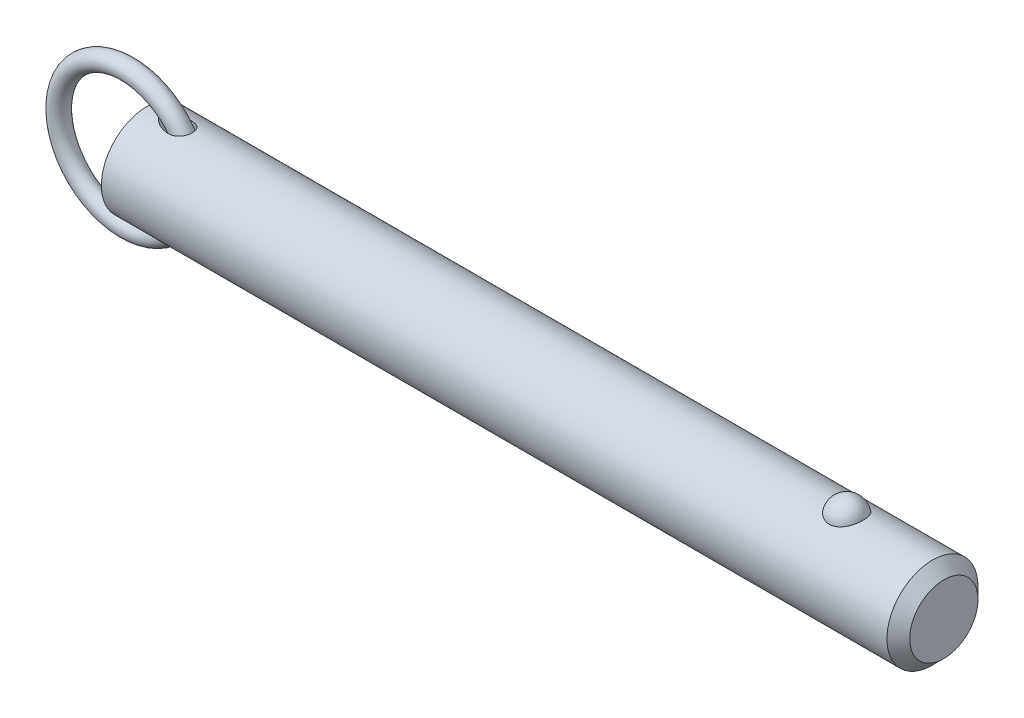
ISO-10303-21;
HEADER;
FILE_DESCRIPTION(('STEP AP214'),'2;1');
FILE_NAME('part.step','',(''),(''),'','','');
FILE_SCHEMA(('AUTOMOTIVE_DESIGN { 1 0 10303 214 1 1 1 1 }'));
ENDSEC;
DATA;
#1=APPLICATION_CONTEXT('core data for automotive mechanical design processes');
#2=APPLICATION_PROTOCOL_DEFINITION('international standard','automotive_design',2000,#1);
#3=PRODUCT_CONTEXT('',#1,'mechanical');
#4=PRODUCT('Part','Part','',(#3));
#5=PRODUCT_RELATED_PRODUCT_CATEGORY('part','',(#4));
#6=PRODUCT_DEFINITION_FORMATION('','',#4);
#7=PRODUCT_DEFINITION_CONTEXT('part definition',#1,'design');
#8=PRODUCT_DEFINITION('design','',#6,#7);
#9=PRODUCT_DEFINITION_SHAPE('','',#8);
#10=(LENGTH_UNIT() NAMED_UNIT(*) SI_UNIT(.MILLI.,.METRE.));
#11=(NAMED_UNIT(*) PLANE_ANGLE_UNIT() SI_UNIT($,.RADIAN.));
#12=(NAMED_UNIT(*) SI_UNIT($,.STERADIAN.) SOLID_ANGLE_UNIT());
#13=UNCERTAINTY_MEASURE_WITH_UNIT(LENGTH_MEASURE(1.E-05),#10,'distance_accuracy_value','');
#14=(GEOMETRIC_REPRESENTATION_CONTEXT(3) GLOBAL_UNCERTAINTY_ASSIGNED_CONTEXT((#13)) GLOBAL_UNIT_ASSIGNED_CONTEXT((#10,
#11,#12)) REPRESENTATION_CONTEXT('',''));
#15=CARTESIAN_POINT('',(0.,0.,0.));
#16=DIRECTION('',(0.,0.,1.));
#17=DIRECTION('',(1.,0.,0.));
#18=AXIS2_PLACEMENT_3D('',#15,#16,#17);
#19=CARTESIAN_POINT('',(-5.53898640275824,0.,0.));
#20=DIRECTION('',(0.,0.,1.));
#21=DIRECTION('',(1.,0.,0.));
#22=AXIS2_PLACEMENT_3D('',#19,#20,#21);
#23=TOROIDAL_SURFACE('',#22,19.05,2.54);
#24=CARTESIAN_POINT('',(16.0510135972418,0.,0.));
#25=VERTEX_POINT('',#24);
#26=VERTEX_LOOP('',#25);
#27=FACE_BOUND('',#26,.T.);
#28=ADVANCED_FACE('P0_F12',(#27),#23,.T.);
#29=CLOSED_SHELL('',(#28));
#30=MANIFOLD_SOLID_BREP('P0_B1',#29);
#31=CARTESIAN_POINT('',(0.,0.,0.));
#32=DIRECTION('',(1.,0.,0.));
#33=DIRECTION('',(0.,0.,-1.));
#34=AXIS2_PLACEMENT_3D('',#31,#32,#33);
#35=CYLINDRICAL_SURFACE('',#34,12.7);
#36=CARTESIAN_POINT('',(219.075,0.,0.));
#37=DIRECTION('',(1.,0.,0.));
#38=DIRECTION('',(0.,0.,-1.));
#39=AXIS2_PLACEMENT_3D('',#36,#37,#38);
#40=CIRCLE('',#39,12.7);
#41=CARTESIAN_POINT('',(219.075,0.,-12.7));
#42=VERTEX_POINT('',#41);
#43=EDGE_CURVE('P1_E89',#42,#42,#40,.T.);
#44=ORIENTED_EDGE('',*,*,#43,.F.);
#45=EDGE_LOOP('',(#44));
#46=FACE_BOUND('',#45,.T.);
#47=CARTESIAN_POINT('',(0.,0.,0.));
#48=DIRECTION('',(1.,0.,0.));
#49=DIRECTION('',(0.,0.,-1.));
#50=AXIS2_PLACEMENT_3D('',#47,#48,#49);
#51=CIRCLE('',#50,12.7);
#52=CARTESIAN_POINT('',(0.,0.,-12.7));
#53=VERTEX_POINT('',#52);
#54=EDGE_CURVE('P1_E52',#53,#53,#51,.T.);
#55=ORIENTED_EDGE('',*,*,#54,.T.);
#56=EDGE_LOOP('',(#55));
#57=FACE_BOUND('',#56,.T.);
#58=CARTESIAN_POINT('',(195.160042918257,11.7500437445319,4.81938502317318));
#59=CARTESIAN_POINT('',(195.035088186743,11.7500430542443,4.81938571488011));
#60=CARTESIAN_POINT('',(194.910144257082,11.7520975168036,4.81438658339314));
#61=CARTESIAN_POINT('',(194.661142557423,11.760253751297,4.79442904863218));
#62=CARTESIAN_POINT('',(194.537085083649,11.7663568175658,4.77946746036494));
#63=CARTESIAN_POINT('',(194.290901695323,11.7824262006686,4.7397141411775));
#64=CARTESIAN_POINT('',(194.168774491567,11.7923898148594,4.71492928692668));
#65=CARTESIAN_POINT('',(193.927187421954,11.8158938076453,4.65571340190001));
#66=CARTESIAN_POINT('',(193.80772859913,11.8294355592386,4.6212786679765));
#67=CARTESIAN_POINT('',(193.572557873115,11.8596812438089,4.54309502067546));
#68=CARTESIAN_POINT('',(193.456839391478,11.8763792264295,4.49936361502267));
#69=CARTESIAN_POINT('',(193.229653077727,11.9124878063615,4.40287235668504));
#70=CARTESIAN_POINT('',(193.118186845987,11.9318994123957,4.35010914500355));
#71=CARTESIAN_POINT('',(192.791278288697,11.9934256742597,4.17881316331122));
#72=CARTESIAN_POINT('',(192.583127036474,12.038858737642,4.04720756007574));
#73=CARTESIAN_POINT('',(192.185850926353,12.1352173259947,3.748564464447));
#74=CARTESIAN_POINT('',(191.997443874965,12.1862630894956,3.58061821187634));
#75=CARTESIAN_POINT('',(191.650521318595,12.2875163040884,3.21600758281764));
#76=CARTESIAN_POINT('',(191.492011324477,12.3377235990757,3.0193379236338));
#77=CARTESIAN_POINT('',(191.20168878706,12.4344923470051,2.592916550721));
#78=CARTESIAN_POINT('',(191.071376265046,12.4807925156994,2.36208286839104));
#79=CARTESIAN_POINT('',(190.849407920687,12.5623454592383,1.88070399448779));
#80=CARTESIAN_POINT('',(190.757755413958,12.5975972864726,1.63015711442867));
#81=CARTESIAN_POINT('',(190.614046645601,12.6538414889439,1.1129886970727));
#82=CARTESIAN_POINT('',(190.562499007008,12.6746503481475,0.846205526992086));
#83=CARTESIAN_POINT('',(190.501977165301,12.699153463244,0.307085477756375));
#84=CARTESIAN_POINT('',(190.493001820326,12.7028481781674,0.034748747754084));
#85=CARTESIAN_POINT('',(190.517731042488,12.6927785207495,-0.506073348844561));
#86=CARTESIAN_POINT('',(190.551189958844,12.6791146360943,-0.774571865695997));
#87=CARTESIAN_POINT('',(190.659687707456,12.635882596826,-1.30170246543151));
#88=CARTESIAN_POINT('',(190.73472729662,12.606314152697,-1.56033436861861));
#89=CARTESIAN_POINT('',(190.92500006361,12.5342328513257,-2.0608389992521));
#90=CARTESIAN_POINT('',(191.040287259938,12.4917026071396,-2.30268867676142));
#91=CARTESIAN_POINT('',(191.308704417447,12.3981123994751,-2.76259600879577));
#92=CARTESIAN_POINT('',(191.461837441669,12.3470517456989,-2.98065173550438));
#93=CARTESIAN_POINT('',(191.803507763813,12.2416045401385,-3.38786328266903));
#94=CARTESIAN_POINT('',(191.992201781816,12.1872040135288,-3.57688418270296));
#95=CARTESIAN_POINT('',(192.400239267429,12.0814086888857,-3.91941073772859));
#96=CARTESIAN_POINT('',(192.619580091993,12.0300136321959,-4.07291945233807));
#97=CARTESIAN_POINT('',(193.078375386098,11.9373542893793,-4.33691289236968));
#98=CARTESIAN_POINT('',(193.317304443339,11.8958982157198,-4.44824125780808));
#99=CARTESIAN_POINT('',(193.81243761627,11.8268116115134,-4.62881985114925));
#100=CARTESIAN_POINT('',(194.068635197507,11.7991758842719,-4.69808589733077));
#101=CARTESIAN_POINT('',(194.577164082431,11.7622209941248,-4.78983181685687));
#102=CARTESIAN_POINT('',(194.829041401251,11.7520502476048,-4.81449025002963));
#103=CARTESIAN_POINT('',(195.333573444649,11.7485796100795,-4.82295735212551));
#104=CARTESIAN_POINT('',(195.586228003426,11.7552763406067,-4.80677420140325));
#105=CARTESIAN_POINT('',(196.076834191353,11.7842584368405,-4.73525430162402));
#106=CARTESIAN_POINT('',(196.314998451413,11.8060486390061,-4.68116061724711));
#107=CARTESIAN_POINT('',(196.778489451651,11.8622750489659,-4.53678133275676));
#108=CARTESIAN_POINT('',(197.003815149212,11.8967122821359,-4.44649279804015));
#109=CARTESIAN_POINT('',(197.440801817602,11.9754603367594,-4.2298761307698));
#110=CARTESIAN_POINT('',(197.652057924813,12.0199699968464,-4.10280539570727));
#111=CARTESIAN_POINT('',(198.050601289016,12.1138028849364,-3.81685409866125));
#112=CARTESIAN_POINT('',(198.237883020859,12.163127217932,-3.65796622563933));
#113=CARTESIAN_POINT('',(198.593350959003,12.2642343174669,-3.30364864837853));
#114=CARTESIAN_POINT('',(198.760111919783,12.3160165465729,-3.10678783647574));
#115=CARTESIAN_POINT('',(199.059579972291,12.4142566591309,-2.68748409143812));
#116=CARTESIAN_POINT('',(199.192280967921,12.4607135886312,-2.4650365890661));
#117=CARTESIAN_POINT('',(199.424691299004,12.5450236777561,-1.9928951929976));
#118=CARTESIAN_POINT('',(199.523215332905,12.5825557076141,-1.74255918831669));
#119=CARTESIAN_POINT('',(199.679227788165,12.6431720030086,-1.22773734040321));
#120=CARTESIAN_POINT('',(199.736715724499,12.6662560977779,-0.963251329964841));
#121=CARTESIAN_POINT('',(199.809544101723,12.6956486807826,-0.4273550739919));
#122=CARTESIAN_POINT('',(199.824837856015,12.7019385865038,-0.155937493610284));
#123=CARTESIAN_POINT('',(199.812779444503,12.6970201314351,0.38592890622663));
#124=CARTESIAN_POINT('',(199.78542805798,12.6858120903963,0.656377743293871));
#125=CARTESIAN_POINT('',(199.713060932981,12.6568455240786,1.05454017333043));
#126=CARTESIAN_POINT('',(199.683796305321,12.6451962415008,1.185778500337));
#127=CARTESIAN_POINT('',(199.615022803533,12.6181819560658,1.44513808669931));
#128=CARTESIAN_POINT('',(199.575517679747,12.6028183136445,1.57326046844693));
#129=CARTESIAN_POINT('',(199.486439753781,12.5687547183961,1.82554978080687));
#130=CARTESIAN_POINT('',(199.436862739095,12.5500533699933,1.94971503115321));
#131=CARTESIAN_POINT('',(199.32792115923,12.5098093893,2.19314370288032));
#132=CARTESIAN_POINT('',(199.268560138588,12.4882677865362,2.31240887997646));
#133=CARTESIAN_POINT('',(199.13997128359,12.4427679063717,2.5459303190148));
#134=CARTESIAN_POINT('',(199.070688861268,12.4187964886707,2.66015396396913));
#135=CARTESIAN_POINT('',(198.922903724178,12.3691892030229,2.88202659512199));
#136=CARTESIAN_POINT('',(198.844404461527,12.3435539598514,2.98967802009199));
#137=CARTESIAN_POINT('',(198.678550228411,12.2912955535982,3.1977438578));
#138=CARTESIAN_POINT('',(198.591191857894,12.2646720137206,3.29815546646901));
#139=CARTESIAN_POINT('',(198.408161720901,12.2111945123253,3.49095035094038));
#140=CARTESIAN_POINT('',(198.312493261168,12.1843406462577,3.58333679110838));
#141=CARTESIAN_POINT('',(198.113627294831,12.1312249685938,3.75922876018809));
#142=CARTESIAN_POINT('',(198.010450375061,12.104961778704,3.84275713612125));
#143=CARTESIAN_POINT('',(197.79701336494,12.0537284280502,4.00056406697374));
#144=CARTESIAN_POINT('',(197.686756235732,12.028757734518,4.07484645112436));
#145=CARTESIAN_POINT('',(197.459755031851,11.9808306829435,4.21367959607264));
#146=CARTESIAN_POINT('',(197.343006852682,11.9578756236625,4.27822410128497));
#147=CARTESIAN_POINT('',(197.10394258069,11.9147184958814,4.39698483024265));
#148=CARTESIAN_POINT('',(196.981628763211,11.894515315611,4.45120522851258));
#149=CARTESIAN_POINT('',(196.722952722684,11.8561129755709,4.55255353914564));
#150=CARTESIAN_POINT('',(196.586223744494,11.8381764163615,4.59884858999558));
#151=CARTESIAN_POINT('',(196.308608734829,11.8069093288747,4.67853897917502));
#152=CARTESIAN_POINT('',(196.167724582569,11.7935767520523,4.71194005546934));
#153=CARTESIAN_POINT('',(195.88309446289,11.7720277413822,4.76552188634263));
#154=CARTESIAN_POINT('',(195.739348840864,11.7638106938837,4.78570422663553));
#155=CARTESIAN_POINT('',(195.450411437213,11.7528195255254,4.81263433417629));
#156=CARTESIAN_POINT('',(195.305219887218,11.7500445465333,4.81938421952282));
#157=CARTESIAN_POINT('',(195.160042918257,11.7500437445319,4.81938502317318));
#158=B_SPLINE_CURVE_WITH_KNOTS('',3,(#58,#59,#60,#61,#62,#63,#64,#65,#66,#67,#68,#69,#70,#71,
#72,#73,#74,#75,#76,#77,#78,#79,#80,#81,#82,#83,#84,#85,#86,#87,#88,#89,#90,#91,#92,#93,#94,#95,
#96,#97,#98,#99,#100,#101,#102,#103,#104,#105,#106,#107,#108,#109,#110,#111,#112,#113,#114,#115,
#116,#117,#118,#119,#120,#121,#122,#123,#124,#125,#126,#127,#128,#129,#130,#131,#132,#133,#134,
#135,#136,#137,#138,#139,#140,#141,#142,#143,#144,#145,#146,#147,#148,#149,#150,#151,#152,#153,
#154,#155,#156,#157),.UNSPECIFIED.,.T.,.F.,(4,2,2,2,2,2,2,2,2,2,2,2,2,2,2,2,2,2,2,2,2,2,2,2,2,2,
2,2,2,2,2,2,2,2,2,2,2,2,2,2,2,2,2,2,2,2,2,2,2,4),(0.,0.374729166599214,0.749578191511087,
1.12416526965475,1.49889629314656,1.87292776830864,2.24709865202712,2.99481328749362,
3.76399449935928,4.53331735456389,5.3368391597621,6.14042986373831,6.95405296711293,
7.76765424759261,8.57656703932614,9.38549455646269,10.1955119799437,11.0055949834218,
11.8193353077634,12.6330054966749,13.4294141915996,14.2255231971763,14.9815786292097,
15.7374826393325,16.4696948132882,17.2019663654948,17.9501979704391,18.6986017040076,
19.4844704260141,20.2704797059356,21.0815215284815,21.8925729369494,22.7045213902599,
23.5164550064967,23.9209608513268,24.3253187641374,24.7298461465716,25.1342272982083,
25.54092555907,25.9474719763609,26.3541750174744,26.7607169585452,27.1661834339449,
27.5714814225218,27.9770386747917,28.3824315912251,28.8181206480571,29.2536155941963,
29.6890582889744,30.1244323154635),.UNSPECIFIED.);
#159=CARTESIAN_POINT('',(195.160042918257,11.7500437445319,4.81938502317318));
#160=VERTEX_POINT('',#159);
#161=EDGE_CURVE('P1_E80',#160,#160,#158,.T.);
#162=ORIENTED_EDGE('',*,*,#161,.T.);
#163=EDGE_LOOP('',(#162));
#164=FACE_BOUND('',#163,.T.);
#165=CARTESIAN_POINT('',(-5.53898640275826,0.,0.));
#166=DIRECTION('',(0.796400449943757,-0.604769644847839,0.));
#167=DIRECTION('',(0.604769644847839,0.796400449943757,0.));
#168=AXIS2_PLACEMENT_3D('',#165,#166,#167);
#169=ELLIPSE('',#168,15.9467514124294,12.7);
#170=CARTESIAN_POINT('',(4.09482149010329,12.6864319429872,0.586893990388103));
#171=VERTEX_POINT('',#170);
#172=CARTESIAN_POINT('',(4.09482149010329,12.6864319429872,-0.586893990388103));
#173=VERTEX_POINT('',#172);
#174=EDGE_CURVE('P1_E47',#171,#173,#169,.F.);
#175=ORIENTED_EDGE('',*,*,#174,.T.);
#176=CARTESIAN_POINT('',(4.0615317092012,12.6905758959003,-0.48916605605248));
#177=CARTESIAN_POINT('',(4.0811137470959,12.6881366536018,-0.552489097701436));
#178=CARTESIAN_POINT('',(4.10417851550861,12.6852663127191,-0.614604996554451));
#179=CARTESIAN_POINT('',(4.15628434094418,12.6787965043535,-0.736067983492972));
#180=CARTESIAN_POINT('',(4.18531032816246,12.6751988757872,-0.795421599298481));
#181=CARTESIAN_POINT('',(4.2791115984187,12.6636052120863,-0.967590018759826));
#182=CARTESIAN_POINT('',(4.35123408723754,12.654730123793,-1.07635920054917));
#183=CARTESIAN_POINT('',(4.49106800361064,12.6376715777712,-1.25922957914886));
#184=CARTESIAN_POINT('',(4.55601066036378,12.6297947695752,-1.33556751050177));
#185=CARTESIAN_POINT('',(4.69223626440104,12.6134116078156,-1.48232741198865));
#186=CARTESIAN_POINT('',(4.76352147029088,12.6049050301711,-1.55274725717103));
#187=CARTESIAN_POINT('',(4.91163946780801,12.587417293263,-1.68868704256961));
#188=CARTESIAN_POINT('',(4.98851399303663,12.5784327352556,-1.75416062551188));
#189=CARTESIAN_POINT('',(5.14630057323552,12.560235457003,-1.88003275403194));
#190=CARTESIAN_POINT('',(5.22721398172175,12.5510226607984,-1.94042957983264));
#191=CARTESIAN_POINT('',(5.45368877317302,12.5256514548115,-2.09966332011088));
#192=CARTESIAN_POINT('',(5.60261616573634,12.5094182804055,-2.19371988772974));
#193=CARTESIAN_POINT('',(5.90795545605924,12.4774211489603,-2.36893890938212));
#194=CARTESIAN_POINT('',(6.064372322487,12.4616575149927,-2.45009264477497));
#195=CARTESIAN_POINT('',(6.3830613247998,12.431227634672,-2.60008249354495));
#196=CARTESIAN_POINT('',(6.54533237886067,12.4165611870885,-2.66892086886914));
#197=CARTESIAN_POINT('',(6.87462618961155,12.3889351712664,-2.79435199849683));
#198=CARTESIAN_POINT('',(7.04164773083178,12.3759751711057,-2.85094785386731));
#199=CARTESIAN_POINT('',(7.38726647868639,12.3518460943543,-2.95377962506));
#200=CARTESIAN_POINT('',(7.56604577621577,12.3407843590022,-2.9994320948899));
#201=CARTESIAN_POINT('',(7.92698692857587,12.3219309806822,-3.07596683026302));
#202=CARTESIAN_POINT('',(8.10914972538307,12.314140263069,-3.1068449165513));
#203=CARTESIAN_POINT('',(8.47511457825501,12.3025918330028,-3.15226850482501));
#204=CARTESIAN_POINT('',(8.65890979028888,12.2988216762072,-3.16686440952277));
#205=CARTESIAN_POINT('',(9.0269608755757,12.2959421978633,-3.17802250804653));
#206=CARTESIAN_POINT('',(9.21121628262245,12.2968292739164,-3.17459864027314));
#207=CARTESIAN_POINT('',(9.61636263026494,12.3045198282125,-3.14471110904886));
#208=CARTESIAN_POINT('',(9.83695552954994,12.3125080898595,-3.1136323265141));
#209=CARTESIAN_POINT('',(10.1619126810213,12.3303028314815,-3.04206574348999));
#210=CARTESIAN_POINT('',(10.2692747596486,12.3372061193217,-3.01403983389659));
#211=CARTESIAN_POINT('',(10.4811758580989,12.3528538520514,-2.94925947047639));
#212=CARTESIAN_POINT('',(10.5857162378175,12.361597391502,-2.91250930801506));
#213=CARTESIAN_POINT('',(10.7921321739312,12.3808585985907,-2.82951748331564));
#214=CARTESIAN_POINT('',(10.8939665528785,12.3913944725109,-2.78317723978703));
#215=CARTESIAN_POINT('',(11.0926118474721,12.4138762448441,-2.68112002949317));
#216=CARTESIAN_POINT('',(11.1894254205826,12.4258213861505,-2.62540809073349));
#217=CARTESIAN_POINT('',(11.3768740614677,12.4507225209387,-2.50465655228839));
#218=CARTESIAN_POINT('',(11.46751150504,12.4636781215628,-2.43962056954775));
#219=CARTESIAN_POINT('',(11.6414572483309,12.4901070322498,-2.30048560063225));
#220=CARTESIAN_POINT('',(11.7247669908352,12.5035802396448,-2.2263884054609));
#221=CARTESIAN_POINT('',(11.8713131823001,12.5285000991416,-2.08117367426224));
#222=CARTESIAN_POINT('',(11.9357009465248,12.5399538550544,-2.0112159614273));
#223=CARTESIAN_POINT('',(12.0576805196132,12.5624496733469,-1.86555293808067));
#224=CARTESIAN_POINT('',(12.1152732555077,12.5734917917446,-1.7898484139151));
#225=CARTESIAN_POINT('',(12.223073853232,12.5947858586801,-1.63327883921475));
#226=CARTESIAN_POINT('',(12.2732844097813,12.6050380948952,-1.55241568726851));
#227=CARTESIAN_POINT('',(12.3658430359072,12.6243983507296,-1.38621267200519));
#228=CARTESIAN_POINT('',(12.4081916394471,12.6335064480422,-1.30087311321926));
#229=CARTESIAN_POINT('',(12.5150098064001,12.6569076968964,-1.05702619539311));
#230=CARTESIAN_POINT('',(12.5703399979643,12.6695746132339,-0.894232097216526));
#231=CARTESIAN_POINT('',(12.6526225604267,12.6886816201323,-0.561391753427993));
#232=CARTESIAN_POINT('',(12.6795825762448,12.6951233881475,-0.391347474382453));
#233=CARTESIAN_POINT('',(12.7041016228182,12.7009766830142,-0.0537636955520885));
#234=CARTESIAN_POINT('',(12.7024538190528,12.7005778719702,0.113714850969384));
#235=CARTESIAN_POINT('',(12.6717240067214,12.6932548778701,0.445979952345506));
#236=CARTESIAN_POINT('',(12.6426435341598,12.6863310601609,0.61076665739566));
#237=CARTESIAN_POINT('',(12.5579769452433,12.6667465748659,0.932429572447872));
#238=CARTESIAN_POINT('',(12.5024793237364,12.6541050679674,1.08933027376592));
#239=CARTESIAN_POINT('',(12.3665691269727,12.6244558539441,1.39146752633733));
#240=CARTESIAN_POINT('',(12.2861577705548,12.6074483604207,1.53670464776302));
#241=CARTESIAN_POINT('',(12.1018203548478,12.5706804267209,1.81319588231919));
#242=CARTESIAN_POINT('',(11.99765881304,12.5508932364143,1.94428915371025));
#243=CARTESIAN_POINT('',(11.7695265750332,12.5107540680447,2.18776051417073));
#244=CARTESIAN_POINT('',(11.6455540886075,12.4904020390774,2.30013691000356));
#245=CARTESIAN_POINT('',(11.3759347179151,12.4502278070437,2.50870972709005));
#246=CARTESIAN_POINT('',(11.2295880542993,12.4304654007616,2.60400962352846));
#247=CARTESIAN_POINT('',(10.9239803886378,12.3941696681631,2.7716292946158));
#248=CARTESIAN_POINT('',(10.7647152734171,12.3776373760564,2.84394171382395));
#249=CARTESIAN_POINT('',(10.4192039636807,12.3473062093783,2.9730352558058));
#250=CARTESIAN_POINT('',(10.2319332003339,12.3340204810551,3.02717164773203));
#251=CARTESIAN_POINT('',(9.85152982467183,12.3134301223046,3.10986173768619));
#252=CARTESIAN_POINT('',(9.65839336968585,12.3061295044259,3.13839827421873));
#253=CARTESIAN_POINT('',(9.31022514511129,12.2982822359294,3.16897517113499));
#254=CARTESIAN_POINT('',(9.15555718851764,12.2966525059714,3.1752689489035));
#255=CARTESIAN_POINT('',(8.84618945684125,12.2967963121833,3.17471335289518));
#256=CARTESIAN_POINT('',(8.69148970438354,12.2985715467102,3.16785742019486));
#257=CARTESIAN_POINT('',(8.38280471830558,12.3051648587,3.14214692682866));
#258=CARTESIAN_POINT('',(8.22882218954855,12.3099904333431,3.12326280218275));
#259=CARTESIAN_POINT('',(7.92276070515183,12.3222644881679,3.07448013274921));
#260=CARTESIAN_POINT('',(7.7706814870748,12.3297126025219,3.04458312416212));
#261=CARTESIAN_POINT('',(7.4645266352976,12.3470493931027,2.97350781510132));
#262=CARTESIAN_POINT('',(7.3105271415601,12.3570043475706,2.93201910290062));
#263=CARTESIAN_POINT('',(7.00579083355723,12.3787609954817,2.83876185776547));
#264=CARTESIAN_POINT('',(6.85505451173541,12.3905629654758,2.78699178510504));
#265=CARTESIAN_POINT('',(6.55781208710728,12.415528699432,2.67357744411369));
#266=CARTESIAN_POINT('',(6.41129783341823,12.4286895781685,2.61195394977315));
#267=CARTESIAN_POINT('',(6.12302950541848,12.4559398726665,2.47874512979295));
#268=CARTESIAN_POINT('',(5.98127390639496,12.4700289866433,2.40716303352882));
#269=CARTESIAN_POINT('',(5.67073126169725,12.5020754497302,2.23550426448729));
#270=CARTESIAN_POINT('',(5.50343839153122,12.5201625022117,2.13268685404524));
#271=CARTESIAN_POINT('',(5.26147616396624,12.5471537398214,1.96522579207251));
#272=CARTESIAN_POINT('',(5.18224299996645,12.5561365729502,1.9071344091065));
#273=CARTESIAN_POINT('',(5.02746475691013,12.573912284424,1.78618989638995));
#274=CARTESIAN_POINT('',(4.95191912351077,12.5827051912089,1.72333748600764));
#275=CARTESIAN_POINT('',(4.81787163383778,12.598469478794,1.6036086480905));
#276=CARTESIAN_POINT('',(4.75865966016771,12.6054958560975,1.54753994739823));
#277=CARTESIAN_POINT('',(4.64406285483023,12.6191906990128,1.43158546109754));
#278=CARTESIAN_POINT('',(4.58867926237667,12.6258590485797,1.37169845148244));
#279=CARTESIAN_POINT('',(4.4301491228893,12.6450546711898,1.18656670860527));
#280=CARTESIAN_POINT('',(4.33372726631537,12.6568788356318,1.05507993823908));
#281=CARTESIAN_POINT('',(4.2125205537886,12.6718304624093,0.848052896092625));
#282=CARTESIAN_POINT('',(4.1766015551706,12.6762773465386,0.77910002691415));
#283=CARTESIAN_POINT('',(4.1126497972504,12.6842122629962,0.637080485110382));
#284=CARTESIAN_POINT('',(4.08466792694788,12.6876941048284,0.563990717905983));
#285=CARTESIAN_POINT('',(4.0615317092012,12.6905758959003,0.489166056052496));
#286=B_SPLINE_CURVE_WITH_KNOTS('',3,(#176,#177,#178,#179,#180,#181,#182,#183,#184,#185,#186,
#187,#188,#189,#190,#191,#192,#193,#194,#195,#196,#197,#198,#199,#200,#201,#202,#203,#204,#205,
#206,#207,#208,#209,#210,#211,#212,#213,#214,#215,#216,#217,#218,#219,#220,#221,#222,#223,#224,
#225,#226,#227,#228,#229,#230,#231,#232,#233,#234,#235,#236,#237,#238,#239,#240,#241,#242,#243,
#244,#245,#246,#247,#248,#249,#250,#251,#252,#253,#254,#255,#256,#257,#258,#259,#260,#261,#262,
#263,#264,#265,#266,#267,#268,#269,#270,#271,#272,#273,#274,#275,#276,#277,#278,#279,#280,#281,
#282,#283,#284,#285),.UNSPECIFIED.,.F.,.F.,(4,2,2,2,2,2,2,2,2,2,2,2,2,2,2,2,2,2,2,2,2,2,2,2,2,2,
2,2,2,2,2,2,2,2,2,2,2,2,2,2,2,2,2,2,2,2,2,2,2,2,2,2,2,2,4),(0.,0.198708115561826,
0.39691995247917,0.787580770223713,1.08882492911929,1.39017679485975,1.69407136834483,
1.99806847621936,2.52793143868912,3.05815092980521,3.58827293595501,4.11826050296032,
4.67218806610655,5.22627222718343,5.77863637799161,6.3305733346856,6.99657211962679,
7.32977411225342,7.66281254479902,7.99946156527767,8.33593054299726,8.67226935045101,
9.00854178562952,9.29544181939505,9.58230266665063,9.86905853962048,10.1557949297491,
10.6702338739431,11.1845341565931,11.6845985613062,12.1846349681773,12.6830079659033,
13.1813565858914,13.68487951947,14.1884479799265,14.713533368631,15.2387866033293,
15.8228373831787,16.407279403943,16.871081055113,17.3351141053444,17.8002921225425,
18.2654052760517,18.7444169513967,19.2235004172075,19.701586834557,20.1795185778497,
20.7699825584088,21.0658110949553,21.3615950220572,21.606957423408,21.8523988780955,
22.3397467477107,22.5729183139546,22.8075527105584),.UNSPECIFIED.);
#287=EDGE_CURVE('P1_E51',#173,#171,#286,.T.);
#288=ORIENTED_EDGE('',*,*,#287,.T.);
#289=EDGE_LOOP('',(#175,#288));
#290=FACE_BOUND('',#289,.T.);
#291=CARTESIAN_POINT('',(-5.53898640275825,0.,0.));
#292=DIRECTION('',(-0.796400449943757,-0.604769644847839,0.));
#293=DIRECTION('',(0.604769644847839,-0.796400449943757,0.));
#294=AXIS2_PLACEMENT_3D('',#291,#292,#293);
#295=ELLIPSE('',#294,15.9467514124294,12.7);
#296=CARTESIAN_POINT('',(4.0948214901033,-12.6864319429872,0.586893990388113));
#297=VERTEX_POINT('',#296);
#298=CARTESIAN_POINT('',(4.0948214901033,-12.6864319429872,-0.586893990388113));
#299=VERTEX_POINT('',#298);
#300=EDGE_CURVE('P1_E28',#297,#299,#295,.F.);
#301=ORIENTED_EDGE('',*,*,#300,.F.);
#302=CARTESIAN_POINT('',(4.0615317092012,-12.6905758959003,0.489166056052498));
#303=CARTESIAN_POINT('',(4.0811137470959,-12.6881366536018,0.552489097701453));
#304=CARTESIAN_POINT('',(4.10417851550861,-12.6852663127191,0.614604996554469));
#305=CARTESIAN_POINT('',(4.15628434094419,-12.6787965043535,0.736067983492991));
#306=CARTESIAN_POINT('',(4.18531032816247,-12.6751988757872,0.795421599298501));
#307=CARTESIAN_POINT('',(4.27911159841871,-12.6636052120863,0.967590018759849));
#308=CARTESIAN_POINT('',(4.35123408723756,-12.654730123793,1.07635920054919));
#309=CARTESIAN_POINT('',(4.49106800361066,-12.6376715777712,1.25922957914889));
#310=CARTESIAN_POINT('',(4.5560106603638,-12.6297947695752,1.3355675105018));
#311=CARTESIAN_POINT('',(4.69223626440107,-12.6134116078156,1.48232741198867));
#312=CARTESIAN_POINT('',(4.76352147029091,-12.6049050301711,1.55274725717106));
#313=CARTESIAN_POINT('',(4.91163946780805,-12.587417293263,1.68868704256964));
#314=CARTESIAN_POINT('',(4.98851399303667,-12.5784327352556,1.75416062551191));
#315=CARTESIAN_POINT('',(5.14630057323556,-12.560235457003,1.88003275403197));
#316=CARTESIAN_POINT('',(5.22721398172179,-12.5510226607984,1.94042957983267));
#317=CARTESIAN_POINT('',(5.45368877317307,-12.5256514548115,2.09966332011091));
#318=CARTESIAN_POINT('',(5.60261616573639,-12.5094182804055,2.19371988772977));
#319=CARTESIAN_POINT('',(5.9079554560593,-12.4774211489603,2.36893890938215));
#320=CARTESIAN_POINT('',(6.06437232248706,-12.4616575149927,2.450092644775));
#321=CARTESIAN_POINT('',(6.38306132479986,-12.431227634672,2.60008249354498));
#322=CARTESIAN_POINT('',(6.54533237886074,-12.4165611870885,2.66892086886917));
#323=CARTESIAN_POINT('',(6.87462618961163,-12.3889351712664,2.79435199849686));
#324=CARTESIAN_POINT('',(7.04164773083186,-12.3759751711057,2.85094785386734));
#325=CARTESIAN_POINT('',(7.38726647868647,-12.3518460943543,2.95377962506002));
#326=CARTESIAN_POINT('',(7.56604577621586,-12.3407843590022,2.99943209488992));
#327=CARTESIAN_POINT('',(7.92698692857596,-12.3219309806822,3.07596683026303));
#328=CARTESIAN_POINT('',(8.10914972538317,-12.314140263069,3.10684491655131));
#329=CARTESIAN_POINT('',(8.47511457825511,-12.3025918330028,3.15226850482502));
#330=CARTESIAN_POINT('',(8.65890979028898,-12.2988216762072,3.16686440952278));
#331=CARTESIAN_POINT('',(9.0269608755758,-12.2959421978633,3.17802250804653));
#332=CARTESIAN_POINT('',(9.21121628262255,-12.2968292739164,3.17459864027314));
#333=CARTESIAN_POINT('',(9.61636263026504,-12.3045198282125,3.14471110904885));
#334=CARTESIAN_POINT('',(9.83695552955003,-12.3125080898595,3.11363232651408));
#335=CARTESIAN_POINT('',(10.1619126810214,-12.3303028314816,3.04206574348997));
#336=CARTESIAN_POINT('',(10.2692747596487,-12.3372061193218,3.01403983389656));
#337=CARTESIAN_POINT('',(10.481175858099,-12.3528538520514,2.94925947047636));
#338=CARTESIAN_POINT('',(10.5857162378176,-12.361597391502,2.91250930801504));
#339=CARTESIAN_POINT('',(10.7921321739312,-12.3808585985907,2.82951748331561));
#340=CARTESIAN_POINT('',(10.8939665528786,-12.3913944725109,2.78317723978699));
#341=CARTESIAN_POINT('',(11.0926118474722,-12.4138762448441,2.68112002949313));
#342=CARTESIAN_POINT('',(11.1894254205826,-12.4258213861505,2.62540809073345));
#343=CARTESIAN_POINT('',(11.3768740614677,-12.4507225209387,2.50465655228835));
#344=CARTESIAN_POINT('',(11.4675115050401,-12.4636781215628,2.43962056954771));
#345=CARTESIAN_POINT('',(11.641457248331,-12.4901070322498,2.30048560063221));
#346=CARTESIAN_POINT('',(11.7247669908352,-12.5035802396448,2.22638840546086));
#347=CARTESIAN_POINT('',(11.8713131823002,-12.5285000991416,2.0811736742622));
#348=CARTESIAN_POINT('',(11.9357009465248,-12.5399538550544,2.01121596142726));
#349=CARTESIAN_POINT('',(12.0576805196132,-12.5624496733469,1.86555293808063));
#350=CARTESIAN_POINT('',(12.1152732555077,-12.5734917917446,1.78984841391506));
#351=CARTESIAN_POINT('',(12.2230738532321,-12.5947858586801,1.63327883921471));
#352=CARTESIAN_POINT('',(12.2732844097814,-12.6050380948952,1.55241568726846));
#353=CARTESIAN_POINT('',(12.3658430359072,-12.6243983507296,1.38621267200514));
#354=CARTESIAN_POINT('',(12.4081916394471,-12.6335064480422,1.30087311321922));
#355=CARTESIAN_POINT('',(12.5150098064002,-12.6569076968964,1.05702619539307));
#356=CARTESIAN_POINT('',(12.5703399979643,-12.6695746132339,0.894232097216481));
#357=CARTESIAN_POINT('',(12.6526225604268,-12.6886816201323,0.561391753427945));
#358=CARTESIAN_POINT('',(12.6795825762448,-12.6951233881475,0.391347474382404));
#359=CARTESIAN_POINT('',(12.7041016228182,-12.7009766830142,0.05376369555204));
#360=CARTESIAN_POINT('',(12.7024538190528,-12.7005778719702,-0.113714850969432));
#361=CARTESIAN_POINT('',(12.6717240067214,-12.6932548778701,-0.445979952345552));
#362=CARTESIAN_POINT('',(12.6426435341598,-12.6863310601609,-0.610766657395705));
#363=CARTESIAN_POINT('',(12.5579769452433,-12.6667465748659,-0.932429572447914));
#364=CARTESIAN_POINT('',(12.5024793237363,-12.6541050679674,-1.08933027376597));
#365=CARTESIAN_POINT('',(12.3665691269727,-12.6244558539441,-1.39146752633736));
#366=CARTESIAN_POINT('',(12.2861577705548,-12.6074483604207,-1.53670464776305));
#367=CARTESIAN_POINT('',(12.1018203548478,-12.5706804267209,-1.81319588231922));
#368=CARTESIAN_POINT('',(11.99765881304,-12.5508932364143,-1.94428915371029));
#369=CARTESIAN_POINT('',(11.7695265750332,-12.5107540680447,-2.18776051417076));
#370=CARTESIAN_POINT('',(11.6455540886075,-12.4904020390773,-2.30013691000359));
#371=CARTESIAN_POINT('',(11.375934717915,-12.4502278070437,-2.50870972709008));
#372=CARTESIAN_POINT('',(11.2295880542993,-12.4304654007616,-2.60400962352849));
#373=CARTESIAN_POINT('',(10.9239803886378,-12.3941696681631,-2.77162929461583));
#374=CARTESIAN_POINT('',(10.764715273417,-12.3776373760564,-2.84394171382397));
#375=CARTESIAN_POINT('',(10.4192039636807,-12.3473062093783,-2.97303525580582));
#376=CARTESIAN_POINT('',(10.2319332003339,-12.3340204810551,-3.02717164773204));
#377=CARTESIAN_POINT('',(9.85152982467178,-12.3134301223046,-3.1098617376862));
#378=CARTESIAN_POINT('',(9.6583933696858,-12.3061295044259,-3.13839827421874));
#379=CARTESIAN_POINT('',(9.31022514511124,-12.2982822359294,-3.168975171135));
#380=CARTESIAN_POINT('',(9.15555718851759,-12.2966525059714,-3.1752689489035));
#381=CARTESIAN_POINT('',(8.8461894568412,-12.2967963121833,-3.17471335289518));
#382=CARTESIAN_POINT('',(8.69148970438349,-12.2985715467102,-3.16785742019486));
#383=CARTESIAN_POINT('',(8.38280471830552,-12.3051648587,-3.14214692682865));
#384=CARTESIAN_POINT('',(8.22882218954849,-12.3099904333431,-3.12326280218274));
#385=CARTESIAN_POINT('',(7.92276070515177,-12.3222644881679,-3.07448013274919));
#386=CARTESIAN_POINT('',(7.77068148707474,-12.329712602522,-3.04458312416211));
#387=CARTESIAN_POINT('',(7.46452663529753,-12.3470493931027,-2.97350781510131));
#388=CARTESIAN_POINT('',(7.31052714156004,-12.3570043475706,-2.9320191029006));
#389=CARTESIAN_POINT('',(7.00579083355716,-12.3787609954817,-2.83876185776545));
#390=CARTESIAN_POINT('',(6.85505451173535,-12.3905629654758,-2.78699178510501));
#391=CARTESIAN_POINT('',(6.55781208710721,-12.415528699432,-2.67357744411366));
#392=CARTESIAN_POINT('',(6.41129783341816,-12.4286895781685,-2.61195394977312));
#393=CARTESIAN_POINT('',(6.12302950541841,-12.4559398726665,-2.47874512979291));
#394=CARTESIAN_POINT('',(5.98127390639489,-12.4700289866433,-2.40716303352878));
#395=CARTESIAN_POINT('',(5.67073126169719,-12.5020754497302,-2.23550426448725));
#396=CARTESIAN_POINT('',(5.50343839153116,-12.5201625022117,-2.1326868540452));
#397=CARTESIAN_POINT('',(5.26147616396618,-12.5471537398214,-1.96522579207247));
#398=CARTESIAN_POINT('',(5.1822429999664,-12.5561365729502,-1.90713440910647));
#399=CARTESIAN_POINT('',(5.02746475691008,-12.573912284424,-1.78618989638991));
#400=CARTESIAN_POINT('',(4.95191912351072,-12.5827051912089,-1.7233374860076));
#401=CARTESIAN_POINT('',(4.81787163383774,-12.598469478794,-1.60360864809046));
#402=CARTESIAN_POINT('',(4.75865966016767,-12.6054958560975,-1.54753994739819));
#403=CARTESIAN_POINT('',(4.64406285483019,-12.6191906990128,-1.43158546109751));
#404=CARTESIAN_POINT('',(4.58867926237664,-12.6258590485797,-1.37169845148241));
#405=CARTESIAN_POINT('',(4.43014912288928,-12.6450546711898,-1.18656670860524));
#406=CARTESIAN_POINT('',(4.33372726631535,-12.6568788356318,-1.05507993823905));
#407=CARTESIAN_POINT('',(4.21252055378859,-12.6718304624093,-0.8480528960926));
#408=CARTESIAN_POINT('',(4.17660155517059,-12.6762773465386,-0.779100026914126));
#409=CARTESIAN_POINT('',(4.11264979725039,-12.6842122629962,-0.637080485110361));
#410=CARTESIAN_POINT('',(4.08466792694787,-12.6876941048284,-0.563990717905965));
#411=CARTESIAN_POINT('',(4.0615317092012,-12.6905758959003,-0.489166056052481));
#412=B_SPLINE_CURVE_WITH_KNOTS('',3,(#302,#303,#304,#305,#306,#307,#308,#309,#310,#311,#312,
#313,#314,#315,#316,#317,#318,#319,#320,#321,#322,#323,#324,#325,#326,#327,#328,#329,#330,#331,
#332,#333,#334,#335,#336,#337,#338,#339,#340,#341,#342,#343,#344,#345,#346,#347,#348,#349,#350,
#351,#352,#353,#354,#355,#356,#357,#358,#359,#360,#361,#362,#363,#364,#365,#366,#367,#368,#369,
#370,#371,#372,#373,#374,#375,#376,#377,#378,#379,#380,#381,#382,#383,#384,#385,#386,#387,#388,
#389,#390,#391,#392,#393,#394,#395,#396,#397,#398,#399,#400,#401,#402,#403,#404,#405,#406,#407,
#408,#409,#410,#411),.UNSPECIFIED.,.F.,.F.,(4,2,2,2,2,2,2,2,2,2,2,2,2,2,2,2,2,2,2,2,2,2,2,2,2,2,
2,2,2,2,2,2,2,2,2,2,2,2,2,2,2,2,2,2,2,2,2,2,2,2,2,2,2,2,4),(0.,0.198708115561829,
0.396919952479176,0.787580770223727,1.08882492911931,1.39017679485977,1.69407136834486,
1.9980684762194,2.52793143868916,3.05815092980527,3.58827293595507,4.11826050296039,
4.67218806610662,5.22627222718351,5.77863637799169,6.33057333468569,6.99657211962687,
7.32977411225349,7.66281254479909,7.99946156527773,8.33593054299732,8.67226935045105,
9.00854178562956,9.29544181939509,9.58230266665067,9.86905853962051,10.1557949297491,
10.6702338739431,11.1845341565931,11.6845985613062,12.1846349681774,12.6830079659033,
13.1813565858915,13.68487951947,14.1884479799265,14.7135333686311,15.2387866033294,
15.8228373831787,16.4072794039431,16.871081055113,17.3351141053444,17.8002921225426,
18.2654052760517,18.7444169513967,19.2235004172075,19.701586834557,20.1795185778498,
20.7699825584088,21.0658110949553,21.3615950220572,21.606957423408,21.8523988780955,
22.3397467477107,22.5729183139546,22.8075527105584),.UNSPECIFIED.);
#413=EDGE_CURVE('P1_E10',#297,#299,#412,.T.);
#414=ORIENTED_EDGE('',*,*,#413,.T.);
#415=EDGE_LOOP('',(#301,#414));
#416=FACE_BOUND('',#415,.T.);
#417=ADVANCED_FACE('P1_F15',(#46,#57,#164,#290,#416),#35,.T.);
#418=CARTESIAN_POINT('',(0.,0.,0.));
#419=DIRECTION('',(-1.,0.,0.));
#420=DIRECTION('',(0.,0.,1.));
#421=AXIS2_PLACEMENT_3D('',#418,#419,#420);
#422=PLANE('',#421);
#423=ORIENTED_EDGE('',*,*,#54,.F.);
#424=EDGE_LOOP('',(#423));
#425=FACE_BOUND('',#424,.T.);
#426=ADVANCED_FACE('P1_F17',(#425),#422,.T.);
#427=CARTESIAN_POINT('',(222.25,0.,0.));
#428=DIRECTION('',(-1.,0.,0.));
#429=DIRECTION('',(0.,0.,1.));
#430=AXIS2_PLACEMENT_3D('',#427,#428,#429);
#431=CONICAL_SURFACE('',#430,9.52500000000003,0.785398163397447);
#432=ORIENTED_EDGE('',*,*,#43,.T.);
#433=EDGE_LOOP('',(#432));
#434=FACE_BOUND('',#433,.T.);
#435=CARTESIAN_POINT('',(222.25,0.,0.));
#436=DIRECTION('',(1.,0.,0.));
#437=DIRECTION('',(0.,0.,-1.));
#438=AXIS2_PLACEMENT_3D('',#435,#436,#437);
#439=CIRCLE('',#438,9.52500000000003);
#440=CARTESIAN_POINT('',(222.25,0.,-9.52500000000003));
#441=VERTEX_POINT('',#440);
#442=EDGE_CURVE('P1_E86',#441,#441,#439,.T.);
#443=ORIENTED_EDGE('',*,*,#442,.F.);
#444=EDGE_LOOP('',(#443));
#445=FACE_BOUND('',#444,.T.);
#446=ADVANCED_FACE('P1_F105',(#434,#445),#431,.T.);
#447=CARTESIAN_POINT('',(222.25,9.52500000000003,0.));
#448=DIRECTION('',(1.,0.,0.));
#449=DIRECTION('',(0.,0.,-1.));
#450=AXIS2_PLACEMENT_3D('',#447,#448,#449);
#451=PLANE('',#450);
#452=ORIENTED_EDGE('',*,*,#442,.T.);
#453=EDGE_LOOP('',(#452));
#454=FACE_BOUND('',#453,.T.);
#455=ADVANCED_FACE('P1_F78',(#454),#451,.T.);
#456=CARTESIAN_POINT('',(195.160042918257,11.43,0.));
#457=DIRECTION('',(-1.,0.,0.));
#458=DIRECTION('',(0.,-1.,0.));
#459=AXIS2_PLACEMENT_3D('',#456,#457,#458);
#460=SPHERICAL_SURFACE('',#459,4.83);
#461=ORIENTED_EDGE('',*,*,#161,.F.);
#462=EDGE_LOOP('',(#461));
#463=FACE_BOUND('',#462,.T.);
#464=ADVANCED_FACE('P1_F71',(#463),#460,.T.);
#465=CARTESIAN_POINT('',(-5.53898640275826,0.,0.));
#466=DIRECTION('',(0.,0.,1.));
#467=DIRECTION('',(1.,0.,0.));
#468=AXIS2_PLACEMENT_3D('',#465,#466,#467);
#469=TOROIDAL_SURFACE('',#468,19.05,3.175);
#470=CARTESIAN_POINT('',(5.98187533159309,-15.1714285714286,0.));
#471=DIRECTION('',(-0.796400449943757,-0.604769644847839,0.));
#472=DIRECTION('',(0.604769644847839,-0.796400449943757,0.));
#473=AXIS2_PLACEMENT_3D('',#470,#471,#472);
#474=CIRCLE('',#473,3.175);
#475=EDGE_CURVE('P1_E34',#297,#299,#474,.T.);
#476=ORIENTED_EDGE('',*,*,#475,.T.);
#477=ORIENTED_EDGE('',*,*,#413,.F.);
#478=EDGE_LOOP('',(#476,#477));
#479=FACE_BOUND('',#478,.T.);
#480=CARTESIAN_POINT('',(5.98187533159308,15.1714285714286,0.));
#481=DIRECTION('',(0.796400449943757,-0.604769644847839,0.));
#482=DIRECTION('',(0.604769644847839,0.796400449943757,0.));
#483=AXIS2_PLACEMENT_3D('',#480,#481,#482);
#484=CIRCLE('',#483,3.175);
#485=EDGE_CURVE('P1_E41',#171,#173,#484,.T.);
#486=ORIENTED_EDGE('',*,*,#485,.F.);
#487=ORIENTED_EDGE('',*,*,#287,.F.);
#488=EDGE_LOOP('',(#486,#487));
#489=FACE_BOUND('',#488,.T.);
#490=ADVANCED_FACE('P1_F55',(#479,#489),#469,.F.);
#491=CARTESIAN_POINT('',(5.98187533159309,-15.1714285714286,0.));
#492=DIRECTION('',(-0.796400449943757,-0.604769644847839,0.));
#493=DIRECTION('',(0.604769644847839,-0.796400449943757,0.));
#494=AXIS2_PLACEMENT_3D('',#491,#492,#493);
#495=PLANE('',#494);
#496=ORIENTED_EDGE('',*,*,#300,.T.);
#497=ORIENTED_EDGE('',*,*,#475,.F.);
#498=EDGE_LOOP('',(#496,#497));
#499=FACE_BOUND('',#498,.T.);
#500=ADVANCED_FACE('P1_F70',(#499),#495,.F.);
#501=CARTESIAN_POINT('',(5.98187533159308,15.1714285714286,0.));
#502=DIRECTION('',(0.796400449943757,-0.604769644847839,0.));
#503=DIRECTION('',(0.604769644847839,0.796400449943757,0.));
#504=AXIS2_PLACEMENT_3D('',#501,#502,#503);
#505=PLANE('',#504);
#506=ORIENTED_EDGE('',*,*,#485,.T.);
#507=ORIENTED_EDGE('',*,*,#174,.F.);
#508=EDGE_LOOP('',(#506,#507));
#509=FACE_BOUND('',#508,.T.);
#510=ADVANCED_FACE('P1_F48',(#509),#505,.T.);
#511=CLOSED_SHELL('',(#417,#426,#446,#455,#464,#490,#500,#510));
#512=MANIFOLD_SOLID_BREP('P1_B1',#511);
#513=ADVANCED_BREP_SHAPE_REPRESENTATION('',(#18,#30,#512),#14);
#514=SHAPE_DEFINITION_REPRESENTATION(#9,#513);
ENDSEC;
END-ISO-10303-21;
